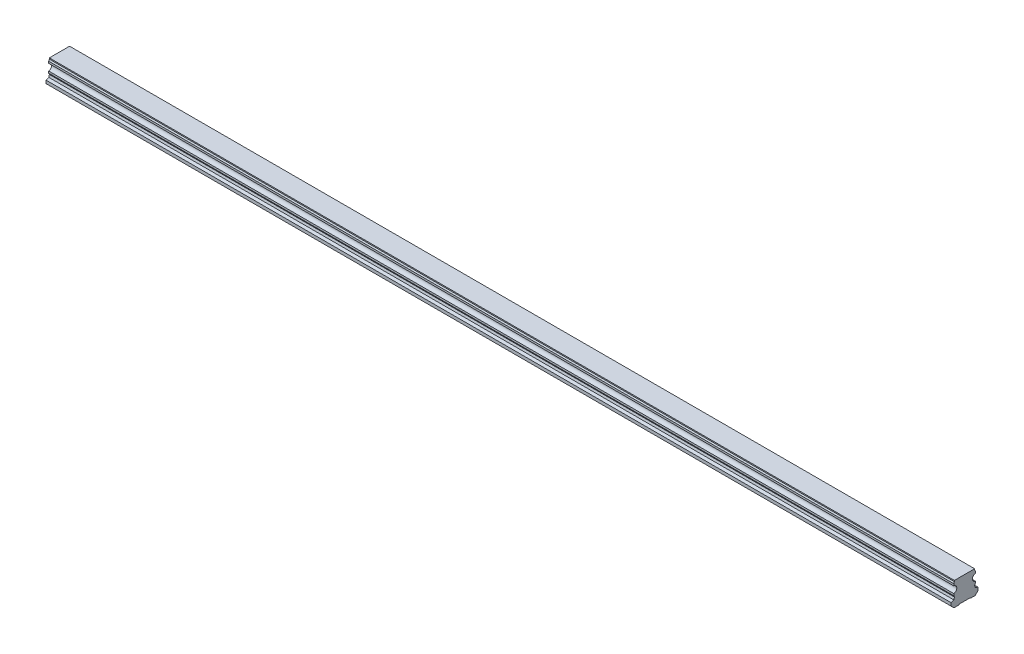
from build123d import *

# Parameters (mm, degrees)
BOSS_EXTRUDE1_DEPTH        = 840
SKETCH3_R                  = 3
SKETCH3_R_2                = 2.5
CUT_EXTRUDE3_DEPTH         = 12
SKETCH3_2_R                = 2.5
CUT_EXTRUDE4_DEPTH         = 15
CHAMFER1_SIZE              = 0.5
LPATTERN4_COUNT            = 14
LPATTERN4_PITCH            = 60
CHAMFER1_OF_LPATTERN4_SIZE = 0.5


with BuildPart() as part:
    # Sketch1 → Boss-Extrude1 (new body)
    with BuildSketch(Plane(origin=(0, 0, 0), x_dir=(0, 0, -1), z_dir=(1, 0, 0))):
        with BuildLine():
            Line((9.375, 21.8), (-9.375, 21.8))
            Line((-9.375, 21.8), (-9.375, 20.756))
            Line((-9.375, 20.756), (-10, 19.415683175))
            Line((-10, 19.415683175), (-10, 17.685449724))
            ThreePointArc((-10, 17.685449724), (-7.2, 14.6), (-10, 11.514550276))
            Line((-10, 11.514550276), (-10, 9.784316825))
            Line((-10, 9.784316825), (-9.375, 8.444))
            Line((-9.375, 8.444), (-9.922688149, 6.4))
            Line((-9.922688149, 6.4), (-12.5, 5.489338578))
            Line((-12.5, 5.489338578), (-12.5, 2.65))
            Line((-12.5, 2.65), (-9.85, 0))
            Line((-9.85, 0), (-5.5, 0))
            Line((-5.5, 0), (-5, 0.5))
            Line((-5, 0.5), (5, 0.5))
            Line((5, 0.5), (5.5, 0))
            Line((5.5, 0), (9.85, 0))
            Line((9.85, 0), (12.5, 2.65))
            Line((12.5, 2.65), (12.5, 5.489338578))
            Line((12.5, 5.489338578), (9.922688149, 6.4))
            Line((9.922688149, 6.4), (9.375, 8.444))
            Line((9.375, 8.444), (10, 9.784316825))
            Line((10, 9.784316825), (10, 11.514550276))
            ThreePointArc((10, 11.514550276), (7.2, 14.6), (10, 17.685449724))
            Line((10, 17.685449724), (10, 19.415683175))
            Line((10, 19.415683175), (9.375, 20.756))
            Line((9.375, 20.756), (9.375, 21.8))
        make_face()
    extrude(amount=BOSS_EXTRUDE1_DEPTH)

    # Sketch3 → Cut-Extrude3 (cut)
    with BuildSketch(Plane.XZ):
        with Locations(Location((30, 0, 0), (0, 0, 270))):
            Circle(SKETCH3_R)
        with Locations(Location((30, 0, 0), (0, 0, 270))):
            Circle(SKETCH3_R_2, mode=Mode.SUBTRACT)
    cut_extrude3 = extrude(amount=-CUT_EXTRUDE3_DEPTH, mode=Mode.SUBTRACT)

    # Sketch3_2 → Cut-Extrude4 (cut)
    with BuildSketch(Plane.XZ):
        with Locations(Location((30, 0, 0), (0, 0, 270))):
            Circle(SKETCH3_2_R)
    cut_extrude4 = extrude(amount=-CUT_EXTRUDE4_DEPTH, mode=Mode.SUBTRACT)

    # Cut-Extrude5 cone 1 section (on through the dimple's axis) → Cut-Extrude5 (revolve, cut)
    with BuildSketch(Plane(origin=(30, 15, 0), x_dir=(0, 0, -1), z_dir=(1, 0, 0))):
        Polygon((0, 0), (2.5, 0), (0, 1.443375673), align=None)
    cut_extrude5 = revolve(axis=Axis((30, 15, 0), (0, 1, 0)), mode=Mode.SUBTRACT)

    # Chamfer1
    chamfer1_edges = [part.edges().sort_by_distance(p)[0] for p in [
        (30, 0.5, 3),
    ]]
    chamfer(chamfer1_edges, length=CHAMFER1_SIZE)

    # LPattern4: Cut-Extrude3, Cut-Extrude4, Cut-Extrude5 ×14
    with Locations(*[(i * LPATTERN4_PITCH, 0, 0) for i in range(1, LPATTERN4_COUNT)]):
        add(cut_extrude3, mode=Mode.SUBTRACT)
        add(cut_extrude4, mode=Mode.SUBTRACT)
        add(cut_extrude5, mode=Mode.SUBTRACT)

    # Chamfer1 of LPattern4
    chamfer1_of_lpattern4_edges = [part.edges().sort_by_distance(p)[0] for p in [
        (90, 0.5, 3),
        (150, 0.5, 3),
        (210, 0.5, 3),
        (270, 0.5, 3),
        (330, 0.5, 3),
        (390, 0.5, 3),
        (450, 0.5, 3),
        (510, 0.5, 3),
        (570, 0.5, 3),
        (630, 0.5, 3),
        (690, 0.5, 3),
        (750, 0.5, 3),
        (810, 0.5, 3),
    ]]
    chamfer(chamfer1_of_lpattern4_edges, length=CHAMFER1_OF_LPATTERN4_SIZE)


solid = part.part
